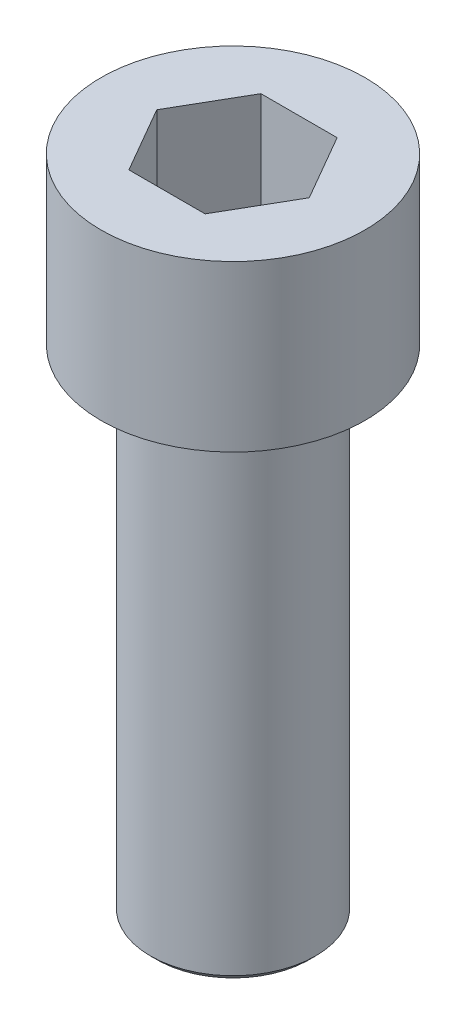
ISO-10303-21;
HEADER;
FILE_DESCRIPTION(('STEP AP214'),'2;1');
FILE_NAME('part.step','',(''),(''),'','','');
FILE_SCHEMA(('AUTOMOTIVE_DESIGN { 1 0 10303 214 1 1 1 1 }'));
ENDSEC;
DATA;
#1=APPLICATION_CONTEXT('core data for automotive mechanical design processes');
#2=APPLICATION_PROTOCOL_DEFINITION('international standard','automotive_design',2000,#1);
#3=PRODUCT_CONTEXT('',#1,'mechanical');
#4=PRODUCT('Part','Part','',(#3));
#5=PRODUCT_RELATED_PRODUCT_CATEGORY('part','',(#4));
#6=PRODUCT_DEFINITION_FORMATION('','',#4);
#7=PRODUCT_DEFINITION_CONTEXT('part definition',#1,'design');
#8=PRODUCT_DEFINITION('design','',#6,#7);
#9=PRODUCT_DEFINITION_SHAPE('','',#8);
#10=(LENGTH_UNIT() NAMED_UNIT(*) SI_UNIT(.MILLI.,.METRE.));
#11=(NAMED_UNIT(*) PLANE_ANGLE_UNIT() SI_UNIT($,.RADIAN.));
#12=(NAMED_UNIT(*) SI_UNIT($,.STERADIAN.) SOLID_ANGLE_UNIT());
#13=UNCERTAINTY_MEASURE_WITH_UNIT(LENGTH_MEASURE(1.E-05),#10,'distance_accuracy_value','');
#14=(GEOMETRIC_REPRESENTATION_CONTEXT(3) GLOBAL_UNCERTAINTY_ASSIGNED_CONTEXT((#13)) GLOBAL_UNIT_ASSIGNED_CONTEXT((#10,
#11,#12)) REPRESENTATION_CONTEXT('',''));
#15=CARTESIAN_POINT('',(0.,0.,0.));
#16=DIRECTION('',(0.,0.,1.));
#17=DIRECTION('',(1.,0.,0.));
#18=AXIS2_PLACEMENT_3D('',#15,#16,#17);
#19=CARTESIAN_POINT('',(0.,0.,0.));
#20=DIRECTION('',(0.,-1.,0.));
#21=DIRECTION('',(0.,0.,-1.));
#22=AXIS2_PLACEMENT_3D('',#19,#20,#21);
#23=PLANE('',#22);
#24=CARTESIAN_POINT('',(0.,0.,0.));
#25=DIRECTION('',(0.,-1.,0.));
#26=DIRECTION('',(0.,0.,-1.));
#27=AXIS2_PLACEMENT_3D('',#24,#25,#26);
#28=CIRCLE('',#27,13.8);
#29=CARTESIAN_POINT('',(0.,0.,-13.8));
#30=VERTEX_POINT('',#29);
#31=EDGE_CURVE('E42',#30,#30,#28,.T.);
#32=ORIENTED_EDGE('',*,*,#31,.T.);
#33=EDGE_LOOP('',(#32));
#34=FACE_BOUND('',#33,.T.);
#35=ADVANCED_FACE('F34',(#34),#23,.T.);
#36=CARTESIAN_POINT('',(0.,0.,0.));
#37=DIRECTION('',(0.,-1.,0.));
#38=DIRECTION('',(0.,0.,-1.));
#39=AXIS2_PLACEMENT_3D('',#36,#37,#38);
#40=CYLINDRICAL_SURFACE('',#39,15.);
#41=CARTESIAN_POINT('',(0.,1.20000000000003,0.));
#42=DIRECTION('',(0.,-1.,0.));
#43=DIRECTION('',(0.,0.,-1.));
#44=AXIS2_PLACEMENT_3D('',#41,#42,#43);
#45=CIRCLE('',#44,15.);
#46=CARTESIAN_POINT('',(0.,1.20000000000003,-15.));
#47=VERTEX_POINT('',#46);
#48=EDGE_CURVE('E11',#47,#47,#45,.F.);
#49=ORIENTED_EDGE('',*,*,#48,.T.);
#50=EDGE_LOOP('',(#49));
#51=FACE_BOUND('',#50,.T.);
#52=CARTESIAN_POINT('',(0.,88.8,0.));
#53=DIRECTION('',(0.,-1.,0.));
#54=DIRECTION('',(0.,0.,-1.));
#55=AXIS2_PLACEMENT_3D('',#52,#53,#54);
#56=CIRCLE('',#55,15.);
#57=CARTESIAN_POINT('',(0.,88.8,-15.));
#58=VERTEX_POINT('',#57);
#59=EDGE_CURVE('E147',#58,#58,#56,.T.);
#60=ORIENTED_EDGE('',*,*,#59,.T.);
#61=EDGE_LOOP('',(#60));
#62=FACE_BOUND('',#61,.T.);
#63=ADVANCED_FACE('F165',(#51,#62),#40,.T.);
#64=CARTESIAN_POINT('',(15.,90.,0.));
#65=DIRECTION('',(0.,-1.,0.));
#66=DIRECTION('',(0.,0.,-1.));
#67=AXIS2_PLACEMENT_3D('',#64,#65,#66);
#68=PLANE('',#67);
#69=CARTESIAN_POINT('',(0.,90.,0.));
#70=DIRECTION('',(0.,-1.,0.));
#71=DIRECTION('',(0.,0.,-1.));
#72=AXIS2_PLACEMENT_3D('',#69,#70,#71);
#73=CIRCLE('',#72,16.2);
#74=CARTESIAN_POINT('',(0.,90.,-16.2));
#75=VERTEX_POINT('',#74);
#76=EDGE_CURVE('E150',#75,#75,#73,.F.);
#77=ORIENTED_EDGE('',*,*,#76,.T.);
#78=EDGE_LOOP('',(#77));
#79=FACE_BOUND('',#78,.T.);
#80=CARTESIAN_POINT('',(0.,90.,0.));
#81=DIRECTION('',(0.,-1.,0.));
#82=DIRECTION('',(0.,0.,-1.));
#83=AXIS2_PLACEMENT_3D('',#80,#81,#82);
#84=CIRCLE('',#83,24.);
#85=CARTESIAN_POINT('',(0.,90.,-24.));
#86=VERTEX_POINT('',#85);
#87=EDGE_CURVE('E144',#86,#86,#84,.T.);
#88=ORIENTED_EDGE('',*,*,#87,.T.);
#89=EDGE_LOOP('',(#88));
#90=FACE_BOUND('',#89,.T.);
#91=ADVANCED_FACE('F170',(#79,#90),#68,.T.);
#92=CARTESIAN_POINT('',(0.,0.,0.));
#93=DIRECTION('',(0.,-1.,0.));
#94=DIRECTION('',(0.,0.,-1.));
#95=AXIS2_PLACEMENT_3D('',#92,#93,#94);
#96=CYLINDRICAL_SURFACE('',#95,24.);
#97=CARTESIAN_POINT('',(0.,120.,0.));
#98=DIRECTION('',(0.,-1.,0.));
#99=DIRECTION('',(0.,0.,-1.));
#100=AXIS2_PLACEMENT_3D('',#97,#98,#99);
#101=CIRCLE('',#100,24.);
#102=CARTESIAN_POINT('',(0.,120.,-24.));
#103=VERTEX_POINT('',#102);
#104=EDGE_CURVE('E136',#103,#103,#101,.T.);
#105=ORIENTED_EDGE('',*,*,#104,.T.);
#106=EDGE_LOOP('',(#105));
#107=FACE_BOUND('',#106,.T.);
#108=ORIENTED_EDGE('',*,*,#87,.F.);
#109=EDGE_LOOP('',(#108));
#110=FACE_BOUND('',#109,.T.);
#111=ADVANCED_FACE('F176',(#107,#110),#96,.T.);
#112=CARTESIAN_POINT('',(24.,120.,0.));
#113=DIRECTION('',(0.,1.,0.));
#114=DIRECTION('',(0.,0.,1.));
#115=AXIS2_PLACEMENT_3D('',#112,#113,#114);
#116=PLANE('',#115);
#117=DIRECTION('',(0.5,0.,-0.866025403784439));
#118=VECTOR('',#117,1.);
#119=CARTESIAN_POINT('',(6.92820323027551,120.,12.));
#120=LINE('',#119,#118);
#121=CARTESIAN_POINT('',(6.92820323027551,120.,12.));
#122=VERTEX_POINT('',#121);
#123=CARTESIAN_POINT('',(13.856406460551,120.,0.));
#124=VERTEX_POINT('',#123);
#125=EDGE_CURVE('E49',#122,#124,#120,.T.);
#126=ORIENTED_EDGE('',*,*,#125,.F.);
#127=DIRECTION('',(1.,0.,0.));
#128=VECTOR('',#127,1.);
#129=CARTESIAN_POINT('',(-6.92820323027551,120.,12.));
#130=LINE('',#129,#128);
#131=CARTESIAN_POINT('',(-6.92820323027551,120.,12.));
#132=VERTEX_POINT('',#131);
#133=EDGE_CURVE('E132',#132,#122,#130,.T.);
#134=ORIENTED_EDGE('',*,*,#133,.F.);
#135=DIRECTION('',(0.5,0.,0.866025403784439));
#136=VECTOR('',#135,1.);
#137=CARTESIAN_POINT('',(-13.856406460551,120.,0.));
#138=LINE('',#137,#136);
#139=CARTESIAN_POINT('',(-13.856406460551,120.,0.));
#140=VERTEX_POINT('',#139);
#141=EDGE_CURVE('E130',#140,#132,#138,.T.);
#142=ORIENTED_EDGE('',*,*,#141,.F.);
#143=DIRECTION('',(-0.5,0.,0.866025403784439));
#144=VECTOR('',#143,1.);
#145=CARTESIAN_POINT('',(-6.92820323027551,120.,-12.));
#146=LINE('',#145,#144);
#147=CARTESIAN_POINT('',(-6.92820323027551,120.,-12.));
#148=VERTEX_POINT('',#147);
#149=EDGE_CURVE('E97',#148,#140,#146,.T.);
#150=ORIENTED_EDGE('',*,*,#149,.F.);
#151=DIRECTION('',(-1.,0.,0.));
#152=VECTOR('',#151,1.);
#153=CARTESIAN_POINT('',(6.9282032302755,120.,-12.));
#154=LINE('',#153,#152);
#155=CARTESIAN_POINT('',(6.9282032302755,120.,-12.));
#156=VERTEX_POINT('',#155);
#157=EDGE_CURVE('E126',#156,#148,#154,.T.);
#158=ORIENTED_EDGE('',*,*,#157,.F.);
#159=DIRECTION('',(-0.5,0.,-0.866025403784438));
#160=VECTOR('',#159,1.);
#161=CARTESIAN_POINT('',(13.856406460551,120.,0.));
#162=LINE('',#161,#160);
#163=EDGE_CURVE('E123',#124,#156,#162,.T.);
#164=ORIENTED_EDGE('',*,*,#163,.F.);
#165=EDGE_LOOP('',(#126,#134,#142,#150,#158,#164));
#166=FACE_BOUND('',#165,.T.);
#167=ORIENTED_EDGE('',*,*,#104,.F.);
#168=EDGE_LOOP('',(#167));
#169=FACE_BOUND('',#168,.T.);
#170=ADVANCED_FACE('F180',(#166,#169),#116,.T.);
#171=CARTESIAN_POINT('',(6.92820323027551,102.,12.));
#172=DIRECTION('',(0.866025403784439,0.,0.5));
#173=DIRECTION('',(0.5,0.,-0.866025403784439));
#174=AXIS2_PLACEMENT_3D('',#171,#172,#173);
#175=PLANE('',#174);
#176=ORIENTED_EDGE('',*,*,#125,.T.);
#177=DIRECTION('',(0.,1.,0.));
#178=VECTOR('',#177,1.);
#179=CARTESIAN_POINT('',(13.856406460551,102.,0.));
#180=LINE('',#179,#178);
#181=CARTESIAN_POINT('',(13.856406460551,102.,0.));
#182=VERTEX_POINT('',#181);
#183=EDGE_CURVE('E79',#182,#124,#180,.T.);
#184=ORIENTED_EDGE('',*,*,#183,.F.);
#185=DIRECTION('',(0.5,0.,-0.866025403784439));
#186=VECTOR('',#185,1.);
#187=CARTESIAN_POINT('',(6.92820323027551,102.,12.));
#188=LINE('',#187,#186);
#189=CARTESIAN_POINT('',(6.92820323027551,102.,12.));
#190=VERTEX_POINT('',#189);
#191=EDGE_CURVE('E134',#190,#182,#188,.T.);
#192=ORIENTED_EDGE('',*,*,#191,.F.);
#193=DIRECTION('',(0.,1.,0.));
#194=VECTOR('',#193,1.);
#195=CARTESIAN_POINT('',(6.92820323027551,102.,12.));
#196=LINE('',#195,#194);
#197=EDGE_CURVE('E57',#190,#122,#196,.T.);
#198=ORIENTED_EDGE('',*,*,#197,.T.);
#199=EDGE_LOOP('',(#176,#184,#192,#198));
#200=FACE_BOUND('',#199,.T.);
#201=ADVANCED_FACE('F184',(#200),#175,.F.);
#202=CARTESIAN_POINT('',(-6.92820323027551,102.,12.));
#203=DIRECTION('',(0.,0.,1.));
#204=DIRECTION('',(1.,0.,0.));
#205=AXIS2_PLACEMENT_3D('',#202,#203,#204);
#206=PLANE('',#205);
#207=ORIENTED_EDGE('',*,*,#133,.T.);
#208=ORIENTED_EDGE('',*,*,#197,.F.);
#209=DIRECTION('',(1.,0.,0.));
#210=VECTOR('',#209,1.);
#211=CARTESIAN_POINT('',(-6.92820323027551,102.,12.));
#212=LINE('',#211,#210);
#213=CARTESIAN_POINT('',(-6.92820323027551,102.,12.));
#214=VERTEX_POINT('',#213);
#215=EDGE_CURVE('E109',#214,#190,#212,.T.);
#216=ORIENTED_EDGE('',*,*,#215,.F.);
#217=DIRECTION('',(0.,1.,0.));
#218=VECTOR('',#217,1.);
#219=CARTESIAN_POINT('',(-6.92820323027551,102.,12.));
#220=LINE('',#219,#218);
#221=EDGE_CURVE('E101',#214,#132,#220,.T.);
#222=ORIENTED_EDGE('',*,*,#221,.T.);
#223=EDGE_LOOP('',(#207,#208,#216,#222));
#224=FACE_BOUND('',#223,.T.);
#225=ADVANCED_FACE('F188',(#224),#206,.F.);
#226=CARTESIAN_POINT('',(-13.856406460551,102.,0.));
#227=DIRECTION('',(-0.866025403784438,0.,0.5));
#228=DIRECTION('',(0.5,0.,0.866025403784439));
#229=AXIS2_PLACEMENT_3D('',#226,#227,#228);
#230=PLANE('',#229);
#231=ORIENTED_EDGE('',*,*,#141,.T.);
#232=ORIENTED_EDGE('',*,*,#221,.F.);
#233=DIRECTION('',(0.5,0.,0.866025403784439));
#234=VECTOR('',#233,1.);
#235=CARTESIAN_POINT('',(-13.856406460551,102.,0.));
#236=LINE('',#235,#234);
#237=CARTESIAN_POINT('',(-13.856406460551,102.,0.));
#238=VERTEX_POINT('',#237);
#239=EDGE_CURVE('E105',#238,#214,#236,.T.);
#240=ORIENTED_EDGE('',*,*,#239,.F.);
#241=DIRECTION('',(0.,1.,0.));
#242=VECTOR('',#241,1.);
#243=CARTESIAN_POINT('',(-13.856406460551,102.,0.));
#244=LINE('',#243,#242);
#245=EDGE_CURVE('E90',#238,#140,#244,.T.);
#246=ORIENTED_EDGE('',*,*,#245,.T.);
#247=EDGE_LOOP('',(#231,#232,#240,#246));
#248=FACE_BOUND('',#247,.T.);
#249=ADVANCED_FACE('F106',(#248),#230,.F.);
#250=CARTESIAN_POINT('',(-6.92820323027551,102.,-12.));
#251=DIRECTION('',(-0.866025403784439,0.,-0.5));
#252=DIRECTION('',(-0.5,0.,0.866025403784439));
#253=AXIS2_PLACEMENT_3D('',#250,#251,#252);
#254=PLANE('',#253);
#255=ORIENTED_EDGE('',*,*,#149,.T.);
#256=ORIENTED_EDGE('',*,*,#245,.F.);
#257=DIRECTION('',(-0.5,0.,0.866025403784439));
#258=VECTOR('',#257,1.);
#259=CARTESIAN_POINT('',(-6.92820323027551,102.,-12.));
#260=LINE('',#259,#258);
#261=CARTESIAN_POINT('',(-6.92820323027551,102.,-12.));
#262=VERTEX_POINT('',#261);
#263=EDGE_CURVE('E94',#262,#238,#260,.T.);
#264=ORIENTED_EDGE('',*,*,#263,.F.);
#265=DIRECTION('',(0.,1.,0.));
#266=VECTOR('',#265,1.);
#267=CARTESIAN_POINT('',(-6.92820323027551,102.,-12.));
#268=LINE('',#267,#266);
#269=EDGE_CURVE('E102',#262,#148,#268,.T.);
#270=ORIENTED_EDGE('',*,*,#269,.T.);
#271=EDGE_LOOP('',(#255,#256,#264,#270));
#272=FACE_BOUND('',#271,.T.);
#273=ADVANCED_FACE('F92',(#272),#254,.F.);
#274=CARTESIAN_POINT('',(6.9282032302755,102.,-12.));
#275=DIRECTION('',(0.,0.,-1.));
#276=DIRECTION('',(-1.,0.,0.));
#277=AXIS2_PLACEMENT_3D('',#274,#275,#276);
#278=PLANE('',#277);
#279=ORIENTED_EDGE('',*,*,#157,.T.);
#280=ORIENTED_EDGE('',*,*,#269,.F.);
#281=DIRECTION('',(-1.,0.,0.));
#282=VECTOR('',#281,1.);
#283=CARTESIAN_POINT('',(6.9282032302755,102.,-12.));
#284=LINE('',#283,#282);
#285=CARTESIAN_POINT('',(6.9282032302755,102.,-12.));
#286=VERTEX_POINT('',#285);
#287=EDGE_CURVE('E115',#286,#262,#284,.T.);
#288=ORIENTED_EDGE('',*,*,#287,.F.);
#289=DIRECTION('',(0.,1.,0.));
#290=VECTOR('',#289,1.);
#291=CARTESIAN_POINT('',(6.9282032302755,102.,-12.));
#292=LINE('',#291,#290);
#293=EDGE_CURVE('E139',#286,#156,#292,.T.);
#294=ORIENTED_EDGE('',*,*,#293,.T.);
#295=EDGE_LOOP('',(#279,#280,#288,#294));
#296=FACE_BOUND('',#295,.T.);
#297=ADVANCED_FACE('F192',(#296),#278,.F.);
#298=CARTESIAN_POINT('',(13.856406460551,102.,0.));
#299=DIRECTION('',(0.866025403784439,0.,-0.5));
#300=DIRECTION('',(-0.5,0.,-0.866025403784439));
#301=AXIS2_PLACEMENT_3D('',#298,#299,#300);
#302=PLANE('',#301);
#303=ORIENTED_EDGE('',*,*,#163,.T.);
#304=ORIENTED_EDGE('',*,*,#293,.F.);
#305=DIRECTION('',(-0.5,0.,-0.866025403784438));
#306=VECTOR('',#305,1.);
#307=CARTESIAN_POINT('',(13.856406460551,102.,0.));
#308=LINE('',#307,#306);
#309=EDGE_CURVE('E117',#182,#286,#308,.T.);
#310=ORIENTED_EDGE('',*,*,#309,.F.);
#311=ORIENTED_EDGE('',*,*,#183,.T.);
#312=EDGE_LOOP('',(#303,#304,#310,#311));
#313=FACE_BOUND('',#312,.T.);
#314=ADVANCED_FACE('F189',(#313),#302,.F.);
#315=CARTESIAN_POINT('',(0.,102.,0.));
#316=DIRECTION('',(0.,1.,0.));
#317=DIRECTION('',(0.,0.,1.));
#318=AXIS2_PLACEMENT_3D('',#315,#316,#317);
#319=PLANE('',#318);
#320=ORIENTED_EDGE('',*,*,#191,.T.);
#321=ORIENTED_EDGE('',*,*,#309,.T.);
#322=ORIENTED_EDGE('',*,*,#287,.T.);
#323=ORIENTED_EDGE('',*,*,#263,.T.);
#324=ORIENTED_EDGE('',*,*,#239,.T.);
#325=ORIENTED_EDGE('',*,*,#215,.T.);
#326=EDGE_LOOP('',(#320,#321,#322,#323,#324,#325));
#327=FACE_BOUND('',#326,.T.);
#328=ADVANCED_FACE('F112',(#327),#319,.T.);
#329=CARTESIAN_POINT('',(0.,88.8,0.));
#330=DIRECTION('',(0.,-1.,0.));
#331=DIRECTION('',(0.,0.,-1.));
#332=AXIS2_PLACEMENT_3D('',#329,#330,#331);
#333=TOROIDAL_SURFACE('',#332,16.2,1.2);
#334=ORIENTED_EDGE('',*,*,#76,.F.);
#335=EDGE_LOOP('',(#334));
#336=FACE_BOUND('',#335,.T.);
#337=ORIENTED_EDGE('',*,*,#59,.F.);
#338=EDGE_LOOP('',(#337));
#339=FACE_BOUND('',#338,.T.);
#340=ADVANCED_FACE('F157',(#336,#339),#333,.F.);
#341=CARTESIAN_POINT('',(0.,0.,0.));
#342=DIRECTION('',(0.,1.,0.));
#343=DIRECTION('',(0.,0.,1.));
#344=AXIS2_PLACEMENT_3D('',#341,#342,#343);
#345=CONICAL_SURFACE('',#344,13.8,0.785398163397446);
#346=ORIENTED_EDGE('',*,*,#48,.F.);
#347=EDGE_LOOP('',(#346));
#348=FACE_BOUND('',#347,.T.);
#349=ORIENTED_EDGE('',*,*,#31,.F.);
#350=EDGE_LOOP('',(#349));
#351=FACE_BOUND('',#350,.T.);
#352=ADVANCED_FACE('F36',(#348,#351),#345,.T.);
#353=CLOSED_SHELL('',(#35,#63,#91,#111,#170,#201,#225,#249,#273,#297,#314,#328,#340,#352));
#354=MANIFOLD_SOLID_BREP('B2',#353);
#355=ADVANCED_BREP_SHAPE_REPRESENTATION('',(#18,#354),#14);
#356=SHAPE_DEFINITION_REPRESENTATION(#9,#355);
ENDSEC;
END-ISO-10303-21;
